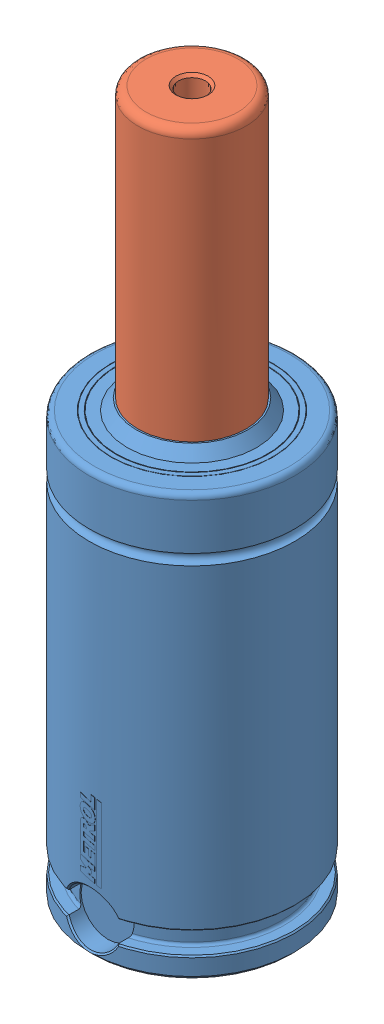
SolidWorks assembly EX0500-050.SLDASM, configuration Default (file format 7000). Lengths in mm.
Overall size (38 130 38.1).
2 component instances, 2 part files, 6 mates.
Components (placement in the parent):
- EX0500 Body-1: EX0500 Body.SLDPRT [EX-500-050] x (0 0 1) z (0 -1 0) size (38.1 38 80)
- EX-500 Piston-1: EX-500 Piston.SLDPRT [EX-500-050] at (0 63 0) x (-1 0 0) z (0 -1 0) size (30 30 67)
Mates (geometry in assembly coordinates):
- Concentric1: concentric aligned: cylinder of EX0500 Body-1 through (0 0 0) axis (0 -1 0) radius 10; cylinder of EX-500 Piston-1 through (0 63 0) axis (0 -1 0) radius 10
- LimitDistance1: limit distance anti-aligned: plane of EX0500 Body-1 through (0 68 0) normal (0 -1 0); plane of EX-500 Piston-1 through (0 68 -15) normal (0 1 0)
- Coincident1: coincident anti-aligned: plane of EX0500 Body-1 through (0 0 0) normal (0 -1 0); plane of assembly through (0 0 0) normal (0 1 0)
- Coincident2: coincident aligned: plane of EX0500 Body-1; plane of assembly through (0 0 0) normal (0 0 1)
- Coincident4: coincident anti-aligned: plane of EX0500 Body-1; plane of assembly through (0 0 0) normal (1 0 0)
- Coincident5: coincident anti-aligned: plane of EX-500 Piston-1; plane of assembly through (0 0 0) normal (0 0 1)
